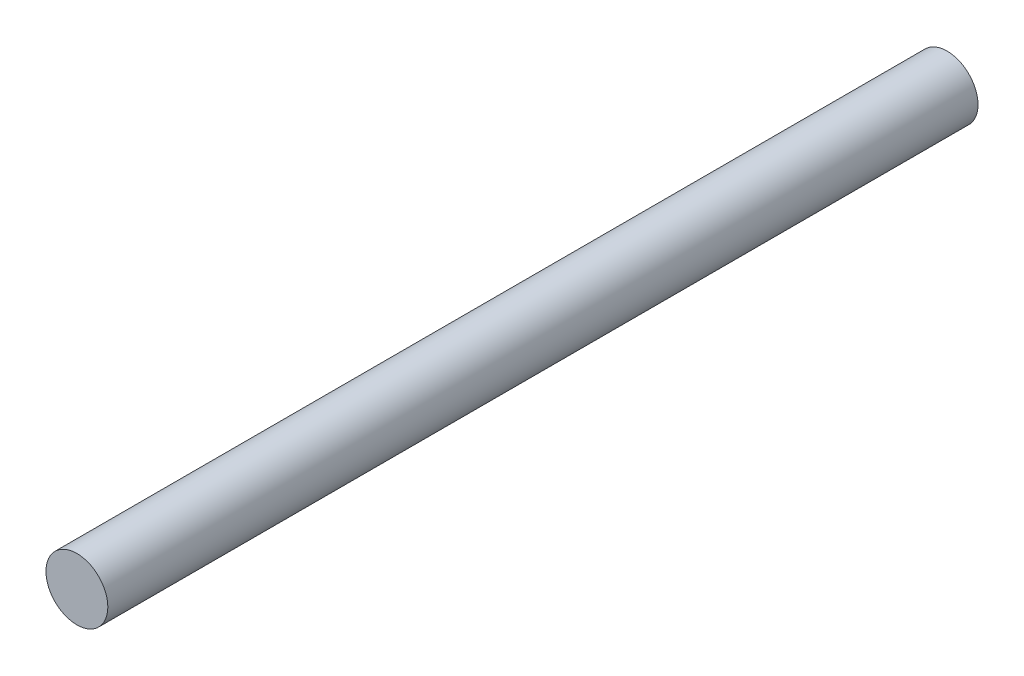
from build123d import *

# Parameters (mm, degrees)
ESQUISSE1_R      = 16
EXTRUSION1_DEPTH = 450


with BuildPart() as part:
    # Esquisse1 → Extrusion1 (new body)
    with BuildSketch(Plane.XY):
        Circle(ESQUISSE1_R)
    extrude(amount=EXTRUSION1_DEPTH)


solid = part.part
